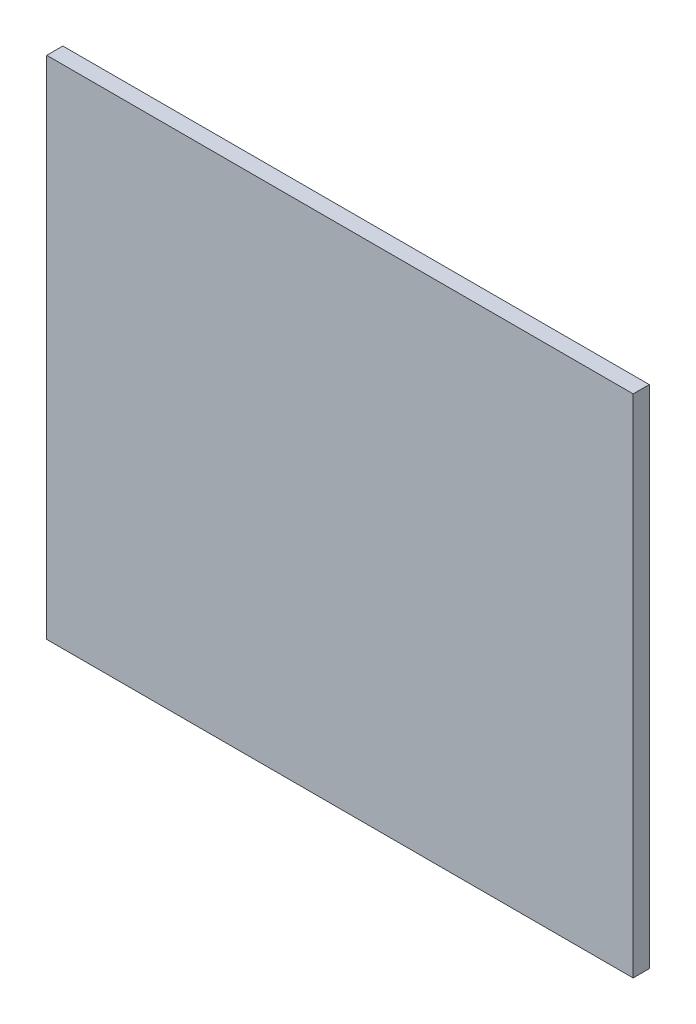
ISO-10303-21;
HEADER;
FILE_DESCRIPTION(('STEP AP214'),'2;1');
FILE_NAME('part.step','',(''),(''),'','','');
FILE_SCHEMA(('AUTOMOTIVE_DESIGN { 1 0 10303 214 1 1 1 1 }'));
ENDSEC;
DATA;
#1=APPLICATION_CONTEXT('core data for automotive mechanical design processes');
#2=APPLICATION_PROTOCOL_DEFINITION('international standard','automotive_design',2000,#1);
#3=PRODUCT_CONTEXT('',#1,'mechanical');
#4=PRODUCT('Part','Part','',(#3));
#5=PRODUCT_RELATED_PRODUCT_CATEGORY('part','',(#4));
#6=PRODUCT_DEFINITION_FORMATION('','',#4);
#7=PRODUCT_DEFINITION_CONTEXT('part definition',#1,'design');
#8=PRODUCT_DEFINITION('design','',#6,#7);
#9=PRODUCT_DEFINITION_SHAPE('','',#8);
#10=(LENGTH_UNIT() NAMED_UNIT(*) SI_UNIT(.MILLI.,.METRE.));
#11=(NAMED_UNIT(*) PLANE_ANGLE_UNIT() SI_UNIT($,.RADIAN.));
#12=(NAMED_UNIT(*) SI_UNIT($,.STERADIAN.) SOLID_ANGLE_UNIT());
#13=UNCERTAINTY_MEASURE_WITH_UNIT(LENGTH_MEASURE(1.E-05),#10,'distance_accuracy_value','');
#14=(GEOMETRIC_REPRESENTATION_CONTEXT(3) GLOBAL_UNCERTAINTY_ASSIGNED_CONTEXT((#13)) GLOBAL_UNIT_ASSIGNED_CONTEXT((#10,
#11,#12)) REPRESENTATION_CONTEXT('',''));
#15=CARTESIAN_POINT('',(0.,0.,0.));
#16=DIRECTION('',(0.,0.,1.));
#17=DIRECTION('',(1.,0.,0.));
#18=AXIS2_PLACEMENT_3D('',#15,#16,#17);
#19=CARTESIAN_POINT('',(-655.,565.,18.));
#20=DIRECTION('',(1.,0.,0.));
#21=DIRECTION('',(0.,1.,0.));
#22=AXIS2_PLACEMENT_3D('',#19,#20,#21);
#23=PLANE('',#22);
#24=DIRECTION('',(0.,-1.,0.));
#25=VECTOR('',#24,1.);
#26=CARTESIAN_POINT('',(-655.,565.,0.));
#27=LINE('',#26,#25);
#28=CARTESIAN_POINT('',(-655.,565.,0.));
#29=VERTEX_POINT('',#28);
#30=CARTESIAN_POINT('',(-655.,0.,0.));
#31=VERTEX_POINT('',#30);
#32=EDGE_CURVE('E95',#29,#31,#27,.T.);
#33=ORIENTED_EDGE('',*,*,#32,.T.);
#34=DIRECTION('',(0.,0.,-1.));
#35=VECTOR('',#34,1.);
#36=CARTESIAN_POINT('',(-655.,0.,18.));
#37=LINE('',#36,#35);
#38=CARTESIAN_POINT('',(-655.,0.,18.));
#39=VERTEX_POINT('',#38);
#40=EDGE_CURVE('E11',#39,#31,#37,.T.);
#41=ORIENTED_EDGE('',*,*,#40,.F.);
#42=DIRECTION('',(0.,-1.,0.));
#43=VECTOR('',#42,1.);
#44=CARTESIAN_POINT('',(-655.,565.,18.));
#45=LINE('',#44,#43);
#46=CARTESIAN_POINT('',(-655.,565.,18.));
#47=VERTEX_POINT('',#46);
#48=EDGE_CURVE('E83',#47,#39,#45,.T.);
#49=ORIENTED_EDGE('',*,*,#48,.F.);
#50=DIRECTION('',(0.,0.,-1.));
#51=VECTOR('',#50,1.);
#52=CARTESIAN_POINT('',(-655.,565.,18.));
#53=LINE('',#52,#51);
#54=EDGE_CURVE('E91',#47,#29,#53,.T.);
#55=ORIENTED_EDGE('',*,*,#54,.T.);
#56=EDGE_LOOP('',(#33,#41,#49,#55));
#57=FACE_BOUND('',#56,.T.);
#58=ADVANCED_FACE('F32',(#57),#23,.F.);
#59=CARTESIAN_POINT('',(-655.,0.,18.));
#60=DIRECTION('',(0.,1.,0.));
#61=DIRECTION('',(0.,0.,1.));
#62=AXIS2_PLACEMENT_3D('',#59,#60,#61);
#63=PLANE('',#62);
#64=DIRECTION('',(1.,0.,0.));
#65=VECTOR('',#64,1.);
#66=CARTESIAN_POINT('',(-655.,0.,0.));
#67=LINE('',#66,#65);
#68=CARTESIAN_POINT('',(0.,0.,0.));
#69=VERTEX_POINT('',#68);
#70=EDGE_CURVE('E87',#31,#69,#67,.T.);
#71=ORIENTED_EDGE('',*,*,#70,.T.);
#72=DIRECTION('',(0.,0.,-1.));
#73=VECTOR('',#72,1.);
#74=CARTESIAN_POINT('',(0.,0.,18.));
#75=LINE('',#74,#73);
#76=CARTESIAN_POINT('',(0.,0.,18.));
#77=VERTEX_POINT('',#76);
#78=EDGE_CURVE('E40',#77,#69,#75,.T.);
#79=ORIENTED_EDGE('',*,*,#78,.F.);
#80=DIRECTION('',(1.,0.,0.));
#81=VECTOR('',#80,1.);
#82=CARTESIAN_POINT('',(-655.,0.,18.));
#83=LINE('',#82,#81);
#84=EDGE_CURVE('E78',#39,#77,#83,.T.);
#85=ORIENTED_EDGE('',*,*,#84,.F.);
#86=ORIENTED_EDGE('',*,*,#40,.T.);
#87=EDGE_LOOP('',(#71,#79,#85,#86));
#88=FACE_BOUND('',#87,.T.);
#89=ADVANCED_FACE('F86',(#88),#63,.F.);
#90=CARTESIAN_POINT('',(0.,565.,18.));
#91=DIRECTION('',(-1.,0.,0.));
#92=DIRECTION('',(0.,-1.,0.));
#93=AXIS2_PLACEMENT_3D('',#90,#91,#92);
#94=PLANE('',#93);
#95=DIRECTION('',(0.,1.,0.));
#96=VECTOR('',#95,1.);
#97=CARTESIAN_POINT('',(0.,565.,0.));
#98=LINE('',#97,#96);
#99=CARTESIAN_POINT('',(0.,565.,0.));
#100=VERTEX_POINT('',#99);
#101=EDGE_CURVE('E65',#69,#100,#98,.T.);
#102=ORIENTED_EDGE('',*,*,#101,.T.);
#103=DIRECTION('',(0.,0.,-1.));
#104=VECTOR('',#103,1.);
#105=CARTESIAN_POINT('',(0.,565.,18.));
#106=LINE('',#105,#104);
#107=CARTESIAN_POINT('',(0.,565.,18.));
#108=VERTEX_POINT('',#107);
#109=EDGE_CURVE('E88',#108,#100,#106,.T.);
#110=ORIENTED_EDGE('',*,*,#109,.F.);
#111=DIRECTION('',(0.,1.,0.));
#112=VECTOR('',#111,1.);
#113=CARTESIAN_POINT('',(0.,565.,18.));
#114=LINE('',#113,#112);
#115=EDGE_CURVE('E81',#77,#108,#114,.T.);
#116=ORIENTED_EDGE('',*,*,#115,.F.);
#117=ORIENTED_EDGE('',*,*,#78,.T.);
#118=EDGE_LOOP('',(#102,#110,#116,#117));
#119=FACE_BOUND('',#118,.T.);
#120=ADVANCED_FACE('F89',(#119),#94,.F.);
#121=CARTESIAN_POINT('',(-655.,565.,18.));
#122=DIRECTION('',(0.,-1.,0.));
#123=DIRECTION('',(0.,0.,-1.));
#124=AXIS2_PLACEMENT_3D('',#121,#122,#123);
#125=PLANE('',#124);
#126=DIRECTION('',(-1.,0.,0.));
#127=VECTOR('',#126,1.);
#128=CARTESIAN_POINT('',(-655.,565.,0.));
#129=LINE('',#128,#127);
#130=EDGE_CURVE('E71',#100,#29,#129,.T.);
#131=ORIENTED_EDGE('',*,*,#130,.T.);
#132=ORIENTED_EDGE('',*,*,#54,.F.);
#133=DIRECTION('',(-1.,0.,0.));
#134=VECTOR('',#133,1.);
#135=CARTESIAN_POINT('',(-655.,565.,18.));
#136=LINE('',#135,#134);
#137=EDGE_CURVE('E48',#108,#47,#136,.T.);
#138=ORIENTED_EDGE('',*,*,#137,.F.);
#139=ORIENTED_EDGE('',*,*,#109,.T.);
#140=EDGE_LOOP('',(#131,#132,#138,#139));
#141=FACE_BOUND('',#140,.T.);
#142=ADVANCED_FACE('F102',(#141),#125,.F.);
#143=CARTESIAN_POINT('',(0.,0.,18.));
#144=DIRECTION('',(0.,0.,1.));
#145=DIRECTION('',(1.,0.,0.));
#146=AXIS2_PLACEMENT_3D('',#143,#144,#145);
#147=PLANE('',#146);
#148=ORIENTED_EDGE('',*,*,#48,.T.);
#149=ORIENTED_EDGE('',*,*,#84,.T.);
#150=ORIENTED_EDGE('',*,*,#115,.T.);
#151=ORIENTED_EDGE('',*,*,#137,.T.);
#152=EDGE_LOOP('',(#148,#149,#150,#151));
#153=FACE_BOUND('',#152,.T.);
#154=ADVANCED_FACE('F79',(#153),#147,.T.);
#155=CARTESIAN_POINT('',(0.,0.,0.));
#156=DIRECTION('',(0.,0.,1.));
#157=DIRECTION('',(1.,0.,0.));
#158=AXIS2_PLACEMENT_3D('',#155,#156,#157);
#159=PLANE('',#158);
#160=ORIENTED_EDGE('',*,*,#32,.F.);
#161=ORIENTED_EDGE('',*,*,#130,.F.);
#162=ORIENTED_EDGE('',*,*,#101,.F.);
#163=ORIENTED_EDGE('',*,*,#70,.F.);
#164=EDGE_LOOP('',(#160,#161,#162,#163));
#165=FACE_BOUND('',#164,.T.);
#166=ADVANCED_FACE('F105',(#165),#159,.F.);
#167=CLOSED_SHELL('',(#58,#89,#120,#142,#154,#166));
#168=MANIFOLD_SOLID_BREP('B2',#167);
#169=ADVANCED_BREP_SHAPE_REPRESENTATION('',(#18,#168),#14);
#170=SHAPE_DEFINITION_REPRESENTATION(#9,#169);
ENDSEC;
END-ISO-10303-21;
